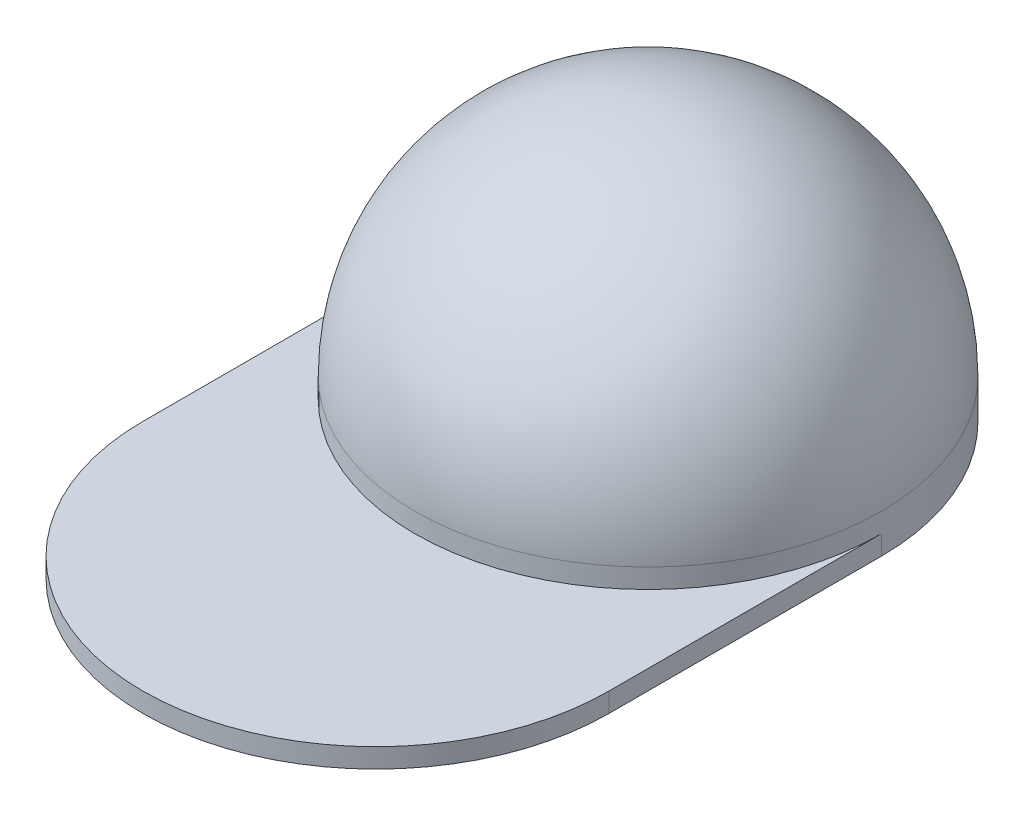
ISO-10303-21;
HEADER;
FILE_DESCRIPTION(('STEP AP214'),'2;1');
FILE_NAME('part.step','',(''),(''),'','','');
FILE_SCHEMA(('AUTOMOTIVE_DESIGN { 1 0 10303 214 1 1 1 1 }'));
ENDSEC;
DATA;
#1=APPLICATION_CONTEXT('core data for automotive mechanical design processes');
#2=APPLICATION_PROTOCOL_DEFINITION('international standard','automotive_design',2000,#1);
#3=PRODUCT_CONTEXT('',#1,'mechanical');
#4=PRODUCT('Part','Part','',(#3));
#5=PRODUCT_RELATED_PRODUCT_CATEGORY('part','',(#4));
#6=PRODUCT_DEFINITION_FORMATION('','',#4);
#7=PRODUCT_DEFINITION_CONTEXT('part definition',#1,'design');
#8=PRODUCT_DEFINITION('design','',#6,#7);
#9=PRODUCT_DEFINITION_SHAPE('','',#8);
#10=(LENGTH_UNIT() NAMED_UNIT(*) SI_UNIT(.MILLI.,.METRE.));
#11=(NAMED_UNIT(*) PLANE_ANGLE_UNIT() SI_UNIT($,.RADIAN.));
#12=(NAMED_UNIT(*) SI_UNIT($,.STERADIAN.) SOLID_ANGLE_UNIT());
#13=UNCERTAINTY_MEASURE_WITH_UNIT(LENGTH_MEASURE(1.E-05),#10,'distance_accuracy_value','');
#14=(GEOMETRIC_REPRESENTATION_CONTEXT(3) GLOBAL_UNCERTAINTY_ASSIGNED_CONTEXT((#13)) GLOBAL_UNIT_ASSIGNED_CONTEXT((#10,
#11,#12)) REPRESENTATION_CONTEXT('',''));
#15=CARTESIAN_POINT('',(0.,0.,0.));
#16=DIRECTION('',(0.,0.,1.));
#17=DIRECTION('',(1.,0.,0.));
#18=AXIS2_PLACEMENT_3D('',#15,#16,#17);
#19=CARTESIAN_POINT('',(4.12,42.,-0.495));
#20=DIRECTION('',(0.,1.,0.));
#21=DIRECTION('',(1.,0.,0.));
#22=AXIS2_PLACEMENT_3D('',#19,#20,#21);
#23=PLANE('',#22);
#24=CARTESIAN_POINT('',(4.12,42.,-0.495));
#25=DIRECTION('',(0.,1.,0.));
#26=DIRECTION('',(-1.,0.,0.));
#27=AXIS2_PLACEMENT_3D('',#24,#25,#26);
#28=CIRCLE('',#27,2.);
#29=CARTESIAN_POINT('',(2.12,42.,-0.495));
#30=VERTEX_POINT('',#29);
#31=EDGE_CURVE('E68',#30,#30,#28,.T.);
#32=ORIENTED_EDGE('',*,*,#31,.F.);
#33=EDGE_LOOP('',(#32));
#34=FACE_BOUND('',#33,.T.);
#35=ADVANCED_FACE('F19',(#34),#23,.F.);
#36=CARTESIAN_POINT('',(4.12,39.5,-0.495));
#37=DIRECTION('',(0.,-1.,0.));
#38=DIRECTION('',(0.,0.,-1.));
#39=AXIS2_PLACEMENT_3D('',#36,#37,#38);
#40=PLANE('',#39);
#41=CARTESIAN_POINT('',(4.12,39.5,-0.495));
#42=DIRECTION('',(0.,-1.,0.));
#43=DIRECTION('',(1.,0.,0.));
#44=AXIS2_PLACEMENT_3D('',#41,#42,#43);
#45=CIRCLE('',#44,2.);
#46=CARTESIAN_POINT('',(6.12,39.5,-0.495));
#47=VERTEX_POINT('',#46);
#48=EDGE_CURVE('E76',#47,#47,#45,.T.);
#49=ORIENTED_EDGE('',*,*,#48,.F.);
#50=EDGE_LOOP('',(#49));
#51=FACE_BOUND('',#50,.T.);
#52=CARTESIAN_POINT('',(4.12,39.5,-0.495));
#53=DIRECTION('',(0.,-1.,0.));
#54=DIRECTION('',(1.,0.,0.));
#55=AXIS2_PLACEMENT_3D('',#52,#53,#54);
#56=CIRCLE('',#55,3.);
#57=CARTESIAN_POINT('',(1.12,39.5,-0.495));
#58=VERTEX_POINT('',#57);
#59=EDGE_CURVE('E22',#58,#58,#56,.T.);
#60=ORIENTED_EDGE('',*,*,#59,.T.);
#61=EDGE_LOOP('',(#60));
#62=FACE_BOUND('',#61,.T.);
#63=ADVANCED_FACE('F167',(#51,#62),#40,.T.);
#64=CARTESIAN_POINT('',(4.12,36.5,-0.495000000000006));
#65=DIRECTION('',(0.,1.,0.));
#66=DIRECTION('',(1.,0.,0.));
#67=AXIS2_PLACEMENT_3D('',#64,#65,#66);
#68=PLANE('',#67);
#69=CARTESIAN_POINT('',(4.12,36.5,-0.495000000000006));
#70=DIRECTION('',(0.,1.,0.));
#71=DIRECTION('',(0.,0.,1.));
#72=AXIS2_PLACEMENT_3D('',#69,#70,#71);
#73=CIRCLE('',#72,5.99814810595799);
#74=CARTESIAN_POINT('',(-1.87814810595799,36.5,-0.495));
#75=VERTEX_POINT('',#74);
#76=CARTESIAN_POINT('',(10.118148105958,36.5,-0.495));
#77=VERTEX_POINT('',#76);
#78=EDGE_CURVE('E122',#75,#77,#73,.T.);
#79=ORIENTED_EDGE('',*,*,#78,.F.);
#80=DIRECTION('',(0.,0.,-1.));
#81=VECTOR('',#80,1.);
#82=CARTESIAN_POINT('',(-1.87814810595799,36.5,-0.495));
#83=LINE('',#82,#81);
#84=CARTESIAN_POINT('',(-1.87814810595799,36.5,6.505));
#85=VERTEX_POINT('',#84);
#86=EDGE_CURVE('E95',#85,#75,#83,.T.);
#87=ORIENTED_EDGE('',*,*,#86,.F.);
#88=CARTESIAN_POINT('',(4.12,36.5,6.505));
#89=DIRECTION('',(0.,-1.,0.));
#90=DIRECTION('',(0.,0.,1.));
#91=AXIS2_PLACEMENT_3D('',#88,#89,#90);
#92=CIRCLE('',#91,5.99814810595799);
#93=CARTESIAN_POINT('',(10.118148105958,36.5,6.505));
#94=VERTEX_POINT('',#93);
#95=EDGE_CURVE('E29',#94,#85,#92,.T.);
#96=ORIENTED_EDGE('',*,*,#95,.F.);
#97=DIRECTION('',(0.,0.,1.));
#98=VECTOR('',#97,1.);
#99=CARTESIAN_POINT('',(10.118148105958,36.5,6.505));
#100=LINE('',#99,#98);
#101=EDGE_CURVE('E11',#77,#94,#100,.T.);
#102=ORIENTED_EDGE('',*,*,#101,.F.);
#103=EDGE_LOOP('',(#79,#87,#96,#102));
#104=FACE_BOUND('',#103,.T.);
#105=ADVANCED_FACE('F172',(#104),#68,.T.);
#106=CARTESIAN_POINT('',(10.118148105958,36.5,6.505));
#107=DIRECTION('',(1.,0.,0.));
#108=DIRECTION('',(0.,1.,0.));
#109=AXIS2_PLACEMENT_3D('',#106,#107,#108);
#110=PLANE('',#109);
#111=DIRECTION('',(0.,0.,1.));
#112=VECTOR('',#111,1.);
#113=CARTESIAN_POINT('',(10.118148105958,36.,6.505));
#114=LINE('',#113,#112);
#115=CARTESIAN_POINT('',(10.118148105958,36.,-0.495));
#116=VERTEX_POINT('',#115);
#117=CARTESIAN_POINT('',(10.118148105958,36.,6.505));
#118=VERTEX_POINT('',#117);
#119=EDGE_CURVE('E107',#116,#118,#114,.T.);
#120=ORIENTED_EDGE('',*,*,#119,.F.);
#121=DIRECTION('',(0.,-1.,0.));
#122=VECTOR('',#121,1.);
#123=CARTESIAN_POINT('',(10.118148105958,36.5,-0.495));
#124=LINE('',#123,#122);
#125=EDGE_CURVE('E89',#77,#116,#124,.T.);
#126=ORIENTED_EDGE('',*,*,#125,.F.);
#127=ORIENTED_EDGE('',*,*,#101,.T.);
#128=DIRECTION('',(0.,-1.,0.));
#129=VECTOR('',#128,1.);
#130=CARTESIAN_POINT('',(10.118148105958,36.5,6.505));
#131=LINE('',#130,#129);
#132=EDGE_CURVE('E99',#94,#118,#131,.T.);
#133=ORIENTED_EDGE('',*,*,#132,.T.);
#134=EDGE_LOOP('',(#120,#126,#127,#133));
#135=FACE_BOUND('',#134,.T.);
#136=ADVANCED_FACE('F177',(#135),#110,.T.);
#137=CARTESIAN_POINT('',(4.12,36.5,6.505));
#138=DIRECTION('',(0.,-1.,0.));
#139=DIRECTION('',(0.,0.,-1.));
#140=AXIS2_PLACEMENT_3D('',#137,#138,#139);
#141=CYLINDRICAL_SURFACE('',#140,5.99814810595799);
#142=CARTESIAN_POINT('',(4.12,36.,6.505));
#143=DIRECTION('',(0.,-1.,0.));
#144=DIRECTION('',(0.,0.,1.));
#145=AXIS2_PLACEMENT_3D('',#142,#143,#144);
#146=CIRCLE('',#145,5.99814810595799);
#147=CARTESIAN_POINT('',(-1.87814810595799,36.,6.505));
#148=VERTEX_POINT('',#147);
#149=EDGE_CURVE('E118',#118,#148,#146,.T.);
#150=ORIENTED_EDGE('',*,*,#149,.F.);
#151=ORIENTED_EDGE('',*,*,#132,.F.);
#152=ORIENTED_EDGE('',*,*,#95,.T.);
#153=DIRECTION('',(0.,-1.,0.));
#154=VECTOR('',#153,1.);
#155=CARTESIAN_POINT('',(-1.87814810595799,36.5,6.505));
#156=LINE('',#155,#154);
#157=EDGE_CURVE('E100',#85,#148,#156,.T.);
#158=ORIENTED_EDGE('',*,*,#157,.T.);
#159=EDGE_LOOP('',(#150,#151,#152,#158));
#160=FACE_BOUND('',#159,.T.);
#161=ADVANCED_FACE('F187',(#160),#141,.T.);
#162=CARTESIAN_POINT('',(-1.87814810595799,36.5,-0.495));
#163=DIRECTION('',(-1.,0.,0.));
#164=DIRECTION('',(0.,0.,1.));
#165=AXIS2_PLACEMENT_3D('',#162,#163,#164);
#166=PLANE('',#165);
#167=DIRECTION('',(0.,0.,-1.));
#168=VECTOR('',#167,1.);
#169=CARTESIAN_POINT('',(-1.87814810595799,36.,-0.495));
#170=LINE('',#169,#168);
#171=CARTESIAN_POINT('',(-1.87814810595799,36.,-0.495));
#172=VERTEX_POINT('',#171);
#173=EDGE_CURVE('E112',#148,#172,#170,.T.);
#174=ORIENTED_EDGE('',*,*,#173,.F.);
#175=ORIENTED_EDGE('',*,*,#157,.F.);
#176=ORIENTED_EDGE('',*,*,#86,.T.);
#177=DIRECTION('',(0.,-1.,0.));
#178=VECTOR('',#177,1.);
#179=CARTESIAN_POINT('',(-1.87814810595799,36.5,-0.495));
#180=LINE('',#179,#178);
#181=EDGE_CURVE('E126',#75,#172,#180,.T.);
#182=ORIENTED_EDGE('',*,*,#181,.T.);
#183=EDGE_LOOP('',(#174,#175,#176,#182));
#184=FACE_BOUND('',#183,.T.);
#185=ADVANCED_FACE('F160',(#184),#166,.T.);
#186=CARTESIAN_POINT('',(9.11814810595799,36.,-0.495));
#187=DIRECTION('',(0.,1.,0.));
#188=DIRECTION('',(1.,0.,0.));
#189=AXIS2_PLACEMENT_3D('',#186,#187,#188);
#190=PLANE('',#189);
#191=CARTESIAN_POINT('',(4.12,36.,-0.495));
#192=DIRECTION('',(0.,1.,0.));
#193=DIRECTION('',(-1.,0.,0.));
#194=AXIS2_PLACEMENT_3D('',#191,#192,#193);
#195=CIRCLE('',#194,4.99814810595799);
#196=CARTESIAN_POINT('',(-0.878148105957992,36.,-0.495));
#197=VERTEX_POINT('',#196);
#198=EDGE_CURVE('E90',#197,#197,#195,.T.);
#199=ORIENTED_EDGE('',*,*,#198,.T.);
#200=EDGE_LOOP('',(#199));
#201=FACE_BOUND('',#200,.T.);
#202=CARTESIAN_POINT('',(4.12,36.,-0.495));
#203=DIRECTION('',(0.,1.,0.));
#204=DIRECTION('',(-1.,0.,0.));
#205=AXIS2_PLACEMENT_3D('',#202,#203,#204);
#206=CIRCLE('',#205,5.99814810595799);
#207=EDGE_CURVE('E108',#116,#172,#206,.T.);
#208=ORIENTED_EDGE('',*,*,#207,.F.);
#209=ORIENTED_EDGE('',*,*,#119,.T.);
#210=ORIENTED_EDGE('',*,*,#149,.T.);
#211=ORIENTED_EDGE('',*,*,#173,.T.);
#212=EDGE_LOOP('',(#208,#209,#210,#211));
#213=FACE_BOUND('',#212,.T.);
#214=ADVANCED_FACE('F149',(#201,#213),#190,.F.);
#215=CARTESIAN_POINT('',(4.12,37.1460575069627,-0.495));
#216=DIRECTION('',(0.,1.,0.));
#217=DIRECTION('',(1.,0.,0.));
#218=AXIS2_PLACEMENT_3D('',#215,#216,#217);
#219=DEGENERATE_TOROIDAL_SURFACE('',#218,0.426586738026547,5.42670074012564,.F.);
#220=CARTESIAN_POINT('',(4.12,41.3540955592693,-0.495));
#221=DIRECTION('',(0.,-1.,0.));
#222=DIRECTION('',(1.,0.,0.));
#223=AXIS2_PLACEMENT_3D('',#220,#221,#222);
#224=CIRCLE('',#223,3.);
#225=CARTESIAN_POINT('',(1.12,41.3540955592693,-0.495));
#226=VERTEX_POINT('',#225);
#227=EDGE_CURVE('E94',#226,#226,#224,.T.);
#228=ORIENTED_EDGE('',*,*,#227,.F.);
#229=EDGE_LOOP('',(#228));
#230=FACE_BOUND('',#229,.T.);
#231=CARTESIAN_POINT('',(4.12,37.,-0.495));
#232=DIRECTION('',(0.,1.,0.));
#233=DIRECTION('',(-1.,0.,0.));
#234=AXIS2_PLACEMENT_3D('',#231,#232,#233);
#235=CIRCLE('',#234,4.99814810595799);
#236=CARTESIAN_POINT('',(-0.878148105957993,37.,-0.495));
#237=VERTEX_POINT('',#236);
#238=EDGE_CURVE('E93',#237,#237,#235,.T.);
#239=ORIENTED_EDGE('',*,*,#238,.F.);
#240=EDGE_LOOP('',(#239));
#241=FACE_BOUND('',#240,.T.);
#242=ADVANCED_FACE('F146',(#230,#241),#219,.T.);
#243=CARTESIAN_POINT('',(4.12,37.,-0.495));
#244=DIRECTION('',(0.,0.,-1.));
#245=DIRECTION('',(1.,0.,0.));
#246=AXIS2_PLACEMENT_3D('',#243,#244,#245);
#247=SPHERICAL_SURFACE('',#246,5.99814810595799);
#248=CARTESIAN_POINT('',(4.12,37.,-0.495));
#249=DIRECTION('',(0.,1.,0.));
#250=DIRECTION('',(-1.,0.,0.));
#251=AXIS2_PLACEMENT_3D('',#248,#249,#250);
#252=SPHERICAL_SURFACE('',#251,5.99814810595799);
#253=CARTESIAN_POINT('',(4.12,37.,-0.495));
#254=DIRECTION('',(0.,1.,0.));
#255=DIRECTION('',(-1.,0.,0.));
#256=AXIS2_PLACEMENT_3D('',#253,#254,#255);
#257=CIRCLE('',#256,5.99814810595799);
#258=CARTESIAN_POINT('',(-1.87814810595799,37.,-0.495));
#259=VERTEX_POINT('',#258);
#260=EDGE_CURVE('E103',#259,#259,#257,.T.);
#261=ORIENTED_EDGE('',*,*,#260,.T.);
#262=EDGE_LOOP('',(#261));
#263=FACE_BOUND('',#262,.T.);
#264=ADVANCED_FACE('F148',(#263),#252,.T.);
#265=CARTESIAN_POINT('',(4.12,42.998148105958,-0.495));
#266=DIRECTION('',(0.,1.,0.));
#267=DIRECTION('',(-1.,0.,0.));
#268=AXIS2_PLACEMENT_3D('',#265,#266,#267);
#269=CYLINDRICAL_SURFACE('',#268,5.99814810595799);
#270=ORIENTED_EDGE('',*,*,#260,.F.);
#271=EDGE_LOOP('',(#270));
#272=FACE_BOUND('',#271,.T.);
#273=ORIENTED_EDGE('',*,*,#181,.F.);
#274=ORIENTED_EDGE('',*,*,#78,.T.);
#275=ORIENTED_EDGE('',*,*,#125,.T.);
#276=ORIENTED_EDGE('',*,*,#207,.T.);
#277=EDGE_LOOP('',(#273,#274,#275,#276));
#278=FACE_BOUND('',#277,.T.);
#279=ADVANCED_FACE('F157',(#272,#278),#269,.T.);
#280=CARTESIAN_POINT('',(4.12,42.998148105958,-0.495));
#281=DIRECTION('',(0.,1.,0.));
#282=DIRECTION('',(-1.,0.,0.));
#283=AXIS2_PLACEMENT_3D('',#280,#281,#282);
#284=CYLINDRICAL_SURFACE('',#283,4.99814810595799);
#285=ORIENTED_EDGE('',*,*,#238,.T.);
#286=EDGE_LOOP('',(#285));
#287=FACE_BOUND('',#286,.T.);
#288=ORIENTED_EDGE('',*,*,#198,.F.);
#289=EDGE_LOOP('',(#288));
#290=FACE_BOUND('',#289,.T.);
#291=ADVANCED_FACE('F143',(#287,#290),#284,.F.);
#292=CARTESIAN_POINT('',(4.12,39.5,-0.495));
#293=DIRECTION('',(0.,1.,0.));
#294=DIRECTION('',(-1.,0.,0.));
#295=AXIS2_PLACEMENT_3D('',#292,#293,#294);
#296=CYLINDRICAL_SURFACE('',#295,3.);
#297=ORIENTED_EDGE('',*,*,#227,.T.);
#298=EDGE_LOOP('',(#297));
#299=FACE_BOUND('',#298,.T.);
#300=ORIENTED_EDGE('',*,*,#59,.F.);
#301=EDGE_LOOP('',(#300));
#302=FACE_BOUND('',#301,.T.);
#303=ADVANCED_FACE('F182',(#299,#302),#296,.T.);
#304=CARTESIAN_POINT('',(4.12,39.5,-0.495));
#305=DIRECTION('',(0.,1.,0.));
#306=DIRECTION('',(-1.,0.,0.));
#307=AXIS2_PLACEMENT_3D('',#304,#305,#306);
#308=CYLINDRICAL_SURFACE('',#307,2.);
#309=ORIENTED_EDGE('',*,*,#31,.T.);
#310=EDGE_LOOP('',(#309));
#311=FACE_BOUND('',#310,.T.);
#312=ORIENTED_EDGE('',*,*,#48,.T.);
#313=EDGE_LOOP('',(#312));
#314=FACE_BOUND('',#313,.T.);
#315=ADVANCED_FACE('F77',(#311,#314),#308,.F.);
#316=CLOSED_SHELL('',(#35,#63,#105,#136,#161,#185,#214,#242,#264,#279,#291,#303,#315));
#317=MANIFOLD_SOLID_BREP('B1',#316);
#318=ADVANCED_BREP_SHAPE_REPRESENTATION('',(#18,#317),#14);
#319=SHAPE_DEFINITION_REPRESENTATION(#9,#318);
ENDSEC;
END-ISO-10303-21;
